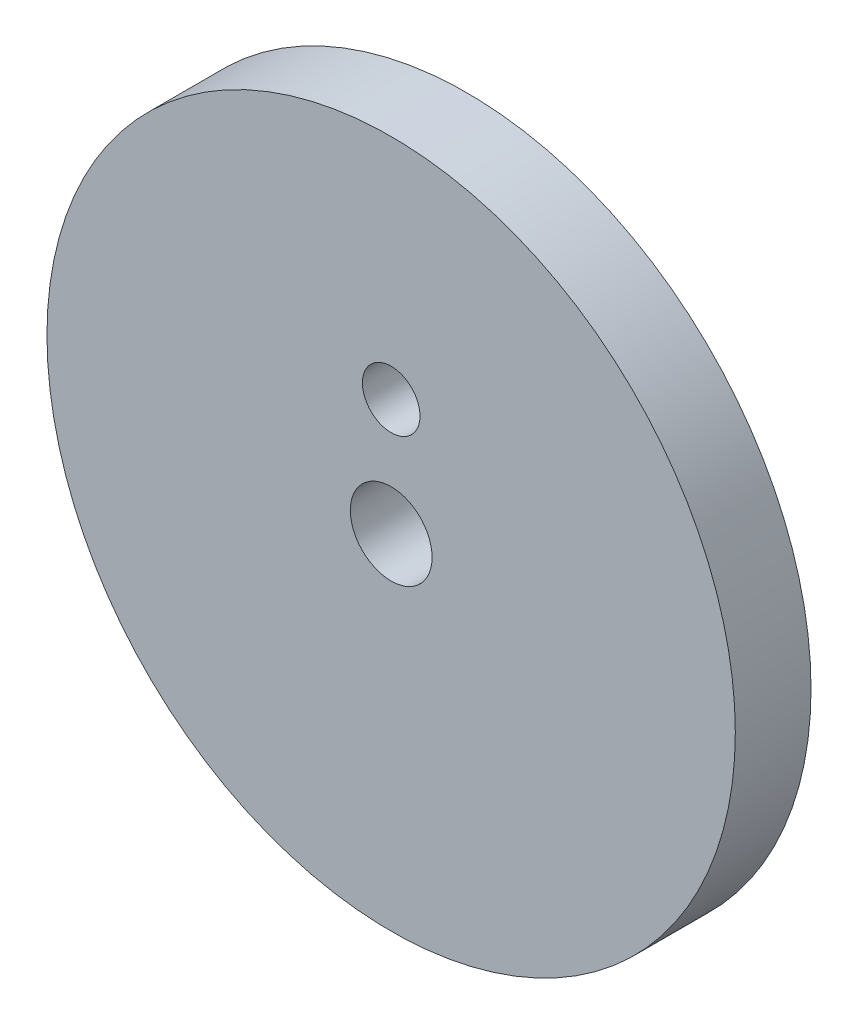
from build123d import *

# Parameters (mm, degrees)
BASE_OUTLINE_R           = 40
EXTRUDE_BASE_DEPTH       = 8.8
TRIPOD_MOUNT_OUTLINE_R   = 4.75
TRIPOD_MOUNT_OUTLINE_R_2 = 3.345362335
CUT_TRIPOD_HOLES_DEPTH   = 8
CAMERA_MOUNT_OUTLINE_R   = 3.1
CUT_CAMERA_HOLES_DEPTH   = 8


with BuildPart() as part:
    # Base Outline → Extrude Base (new body)
    with BuildSketch(Plane.XY):
        Circle(BASE_OUTLINE_R)
    extrude(amount=EXTRUDE_BASE_DEPTH)

    # Tripod Mount Outline → Cut Tripod Holes (cut)
    with BuildSketch(Plane.XY.offset(8.8)):
        with Locations((0.005219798, 0.001535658)):
            Circle(TRIPOD_MOUNT_OUTLINE_R)
        with Locations((0.005219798, 13.529871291)):
            Circle(TRIPOD_MOUNT_OUTLINE_R_2)
    extrude(amount=-CUT_TRIPOD_HOLES_DEPTH, mode=Mode.SUBTRACT)

    # Camera Mount Outline → Cut Camera Holes (cut)
    with BuildSketch(Plane(origin=(0, 0, 0), x_dir=(-1, 0, 0), z_dir=(0, 0, -1))):
        with Locations((0, 32.747673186)):
            Circle(CAMERA_MOUNT_OUTLINE_R)
        with Locations((28.360316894, -16.373836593)):
            Circle(CAMERA_MOUNT_OUTLINE_R)
        with Locations((-28.360316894, -16.373836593)):
            Circle(CAMERA_MOUNT_OUTLINE_R)
    extrude(amount=-CUT_CAMERA_HOLES_DEPTH, mode=Mode.SUBTRACT)


solid = part.part
